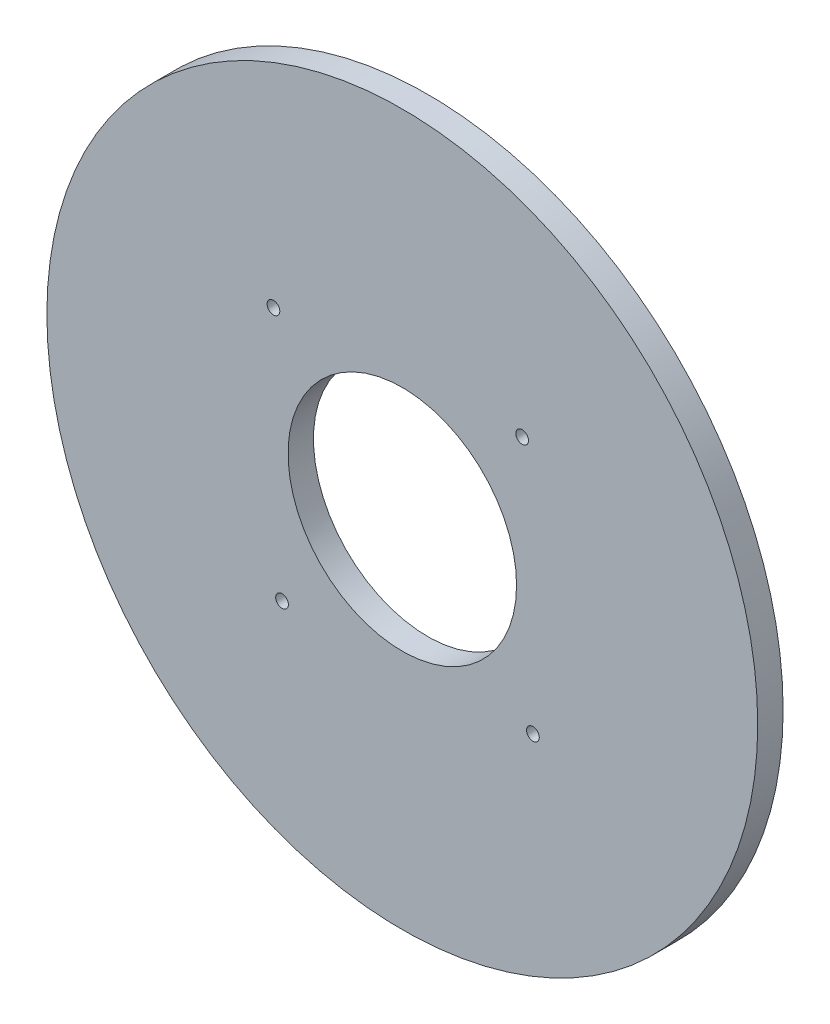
from build123d import *

# Parameters (mm, degrees)
SKETCH1_R           = 88.9
BOSS_EXTRUDE1_DEPTH = 6.35
SKETCH2_R           = 28.575
CUT_EXTRUDE1_DEPTH  = 6.35
SKETCH4_R           = 1.5875
CUT_EXTRUDE2_DEPTH  = 6.35
SKETCH5_R           = 1.5875
CUT_EXTRUDE3_DEPTH  = 6.35
SKETCH6_R           = 1.5875
CUT_EXTRUDE4_DEPTH  = 6.35
SKETCH7_R           = 1.5875
CUT_EXTRUDE5_DEPTH  = 6.35


with BuildPart() as part:
    # Sketch1 → Boss-Extrude1 (new body)
    with BuildSketch(Plane.XY):
        Circle(SKETCH1_R)
    extrude(amount=BOSS_EXTRUDE1_DEPTH)

    # Sketch2 → Cut-Extrude1 (cut)
    with BuildSketch(Plane.XY.offset(6.35)):
        Circle(SKETCH2_R)
    extrude(amount=-CUT_EXTRUDE1_DEPTH, mode=Mode.SUBTRACT)

    # Sketch4 → Cut-Extrude2 (cut)
    with BuildSketch(Plane(origin=(0, 0, 0), x_dir=(-1, 0, 0), z_dir=(0, 0, -1))):
        with Locations((32.229029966, 29.737897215)):
            Circle(SKETCH4_R)
    extrude(amount=-CUT_EXTRUDE2_DEPTH, mode=Mode.SUBTRACT)

    # Sketch5 → Cut-Extrude3 (cut)
    with BuildSketch(Plane(origin=(0, 0, 0), x_dir=(-1, 0, 0), z_dir=(0, 0, -1))):
        with Locations((30.085082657, -32.721404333)):
            Circle(SKETCH5_R)
    extrude(amount=-CUT_EXTRUDE3_DEPTH, mode=Mode.SUBTRACT)

    # Sketch6 → Cut-Extrude4 (cut)
    with BuildSketch(Plane(origin=(0, 0, 0), x_dir=(-1, 0, 0), z_dir=(0, 0, -1))):
        with Locations((-32.673860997, -30.136710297)):
            Circle(SKETCH6_R)
    extrude(amount=-CUT_EXTRUDE4_DEPTH, mode=Mode.SUBTRACT)

    # Sketch7 → Cut-Extrude5 (cut)
    with BuildSketch(Plane(origin=(0, 0, 0), x_dir=(-1, 0, 0), z_dir=(0, 0, -1))):
        with Locations((-29.976922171, 32.820521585)):
            Circle(SKETCH7_R)
    extrude(amount=-CUT_EXTRUDE5_DEPTH, mode=Mode.SUBTRACT)


solid = part.part
